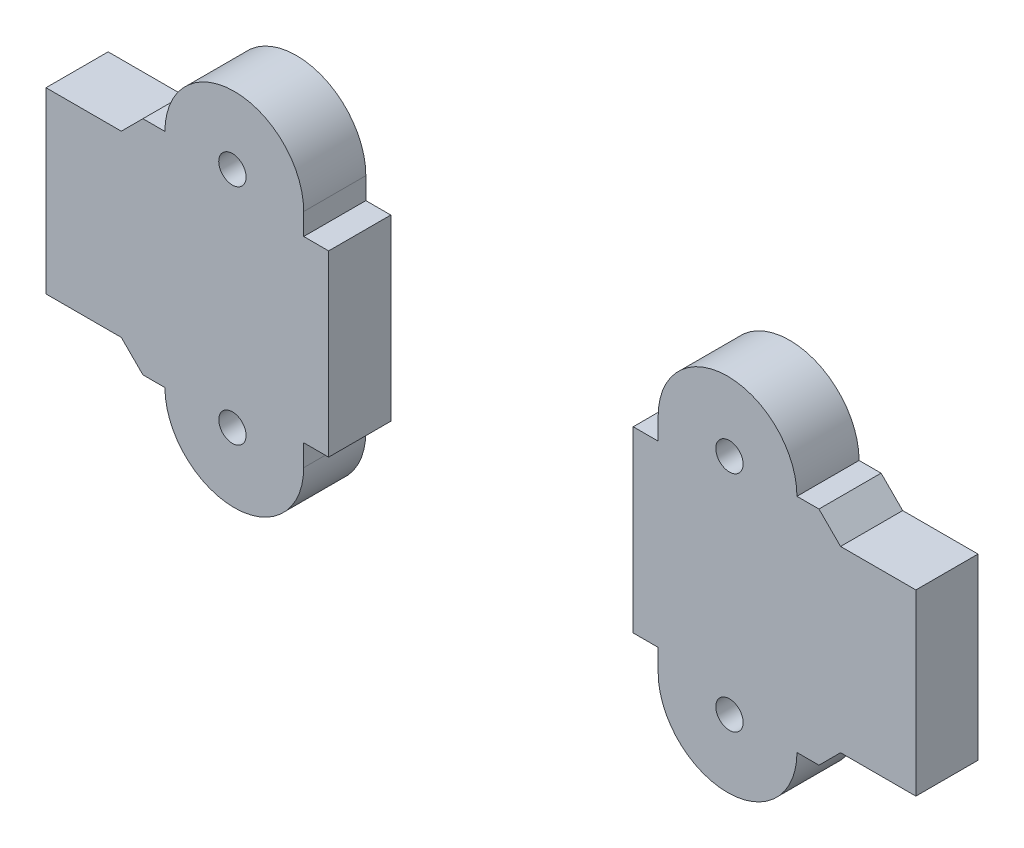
from build123d import *

# Parameters (mm, degrees)
SKETCH1_R             = 1.1
BOSS_EXTRUDE2_DEPTH   = 5
BOSS_EXTRUDE2_2_DEPTH = 5


with BuildPart() as part:
    # Sketch1 → Boss-Extrude2 (new body)
    with BuildSketch(Plane.XY):
        with BuildLine():
            Line((-35, -22.186834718), (-28.940723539, -22.186834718))
            Line((-28.940723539, -22.186834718), (-27.201404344, -23.926153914))
            Line((-27.201404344, -23.926153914), (-25.430875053, -23.926153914))
            ThreePointArc((-25.430875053, -23.926153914), (-19.846202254, -29.510826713), (-14.261529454, -23.926153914))
            Line((-14.261529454, -23.926153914), (-14.261529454, -22.186834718))
            Line((-14.261529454, -22.186834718), (-12.254990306, -22.186834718))
            Line((-12.254990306, -22.186834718), (-12.254990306, -7.813165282))
            Line((-12.254990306, -7.813165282), (-14.261529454, -7.813165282))
            Line((-14.261529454, -7.813165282), (-14.261529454, -6.073846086))
            ThreePointArc((-14.261529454, -6.073846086), (-19.846202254, -0.489173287), (-25.430875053, -6.073846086))
            Line((-25.430875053, -6.073846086), (-27.201404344, -6.073846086))
            Line((-27.201404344, -6.073846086), (-28.940723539, -7.813165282))
            Line((-28.940723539, -7.813165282), (-35, -7.813165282))
            Line((-35, -7.813165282), (-35, -22.186834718))
        make_face()
        with Locations((-20, -24)):
            Circle(SKETCH1_R, mode=Mode.SUBTRACT)
        with Locations(Location((-20, -6, 0), (0, 0, 180))):
            Circle(SKETCH1_R, mode=Mode.SUBTRACT)
    extrude(amount=BOSS_EXTRUDE2_DEPTH)


with BuildPart() as body_2:
    # Sketch1 → Boss-Extrude2 2 (new body)
    with BuildSketch(Plane.XY):
        with BuildLine():
            Line((35, -7.813165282), (28.940723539, -7.813165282))
            Line((28.940723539, -7.813165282), (27.201404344, -6.073846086))
            Line((27.201404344, -6.073846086), (25.430875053, -6.073846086))
            ThreePointArc((25.430875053, -6.073846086), (19.846202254, -0.489173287), (14.261529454, -6.073846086))
            Line((14.261529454, -6.073846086), (14.261529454, -7.813165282))
            Line((14.261529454, -7.813165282), (12.254990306, -7.813165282))
            Line((12.254990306, -7.813165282), (12.254990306, -22.186834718))
            Line((12.254990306, -22.186834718), (14.261529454, -22.186834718))
            Line((14.261529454, -22.186834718), (14.261529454, -23.926153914))
            ThreePointArc((14.261529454, -23.926153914), (19.846202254, -29.510826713), (25.430875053, -23.926153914))
            Line((25.430875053, -23.926153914), (27.201404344, -23.926153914))
            Line((27.201404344, -23.926153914), (28.940723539, -22.186834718))
            Line((28.940723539, -22.186834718), (35, -22.186834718))
            Line((35, -22.186834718), (35, -7.813165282))
        make_face()
        with Locations((20, -6)):
            Circle(SKETCH1_R, mode=Mode.SUBTRACT)
        with Locations(Location((20, -24, 0), (0, 0, 180))):
            Circle(SKETCH1_R, mode=Mode.SUBTRACT)
    extrude(amount=BOSS_EXTRUDE2_2_DEPTH)


solid = Compound([part.part, body_2.part])
